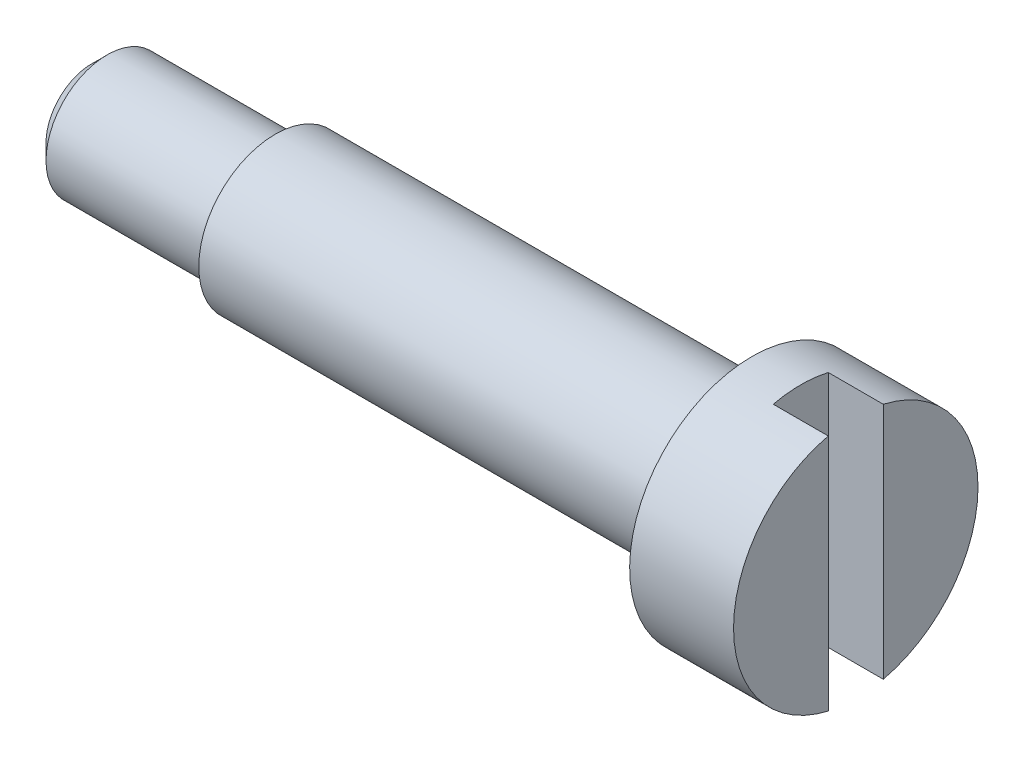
ISO-10303-21;
HEADER;
FILE_DESCRIPTION(('STEP AP214'),'2;1');
FILE_NAME('part.step','',(''),(''),'','','');
FILE_SCHEMA(('AUTOMOTIVE_DESIGN { 1 0 10303 214 1 1 1 1 }'));
ENDSEC;
DATA;
#1=APPLICATION_CONTEXT('core data for automotive mechanical design processes');
#2=APPLICATION_PROTOCOL_DEFINITION('international standard','automotive_design',2000,#1);
#3=PRODUCT_CONTEXT('',#1,'mechanical');
#4=PRODUCT('Part','Part','',(#3));
#5=PRODUCT_RELATED_PRODUCT_CATEGORY('part','',(#4));
#6=PRODUCT_DEFINITION_FORMATION('','',#4);
#7=PRODUCT_DEFINITION_CONTEXT('part definition',#1,'design');
#8=PRODUCT_DEFINITION('design','',#6,#7);
#9=PRODUCT_DEFINITION_SHAPE('','',#8);
#10=(LENGTH_UNIT() NAMED_UNIT(*) SI_UNIT(.MILLI.,.METRE.));
#11=(NAMED_UNIT(*) PLANE_ANGLE_UNIT() SI_UNIT($,.RADIAN.));
#12=(NAMED_UNIT(*) SI_UNIT($,.STERADIAN.) SOLID_ANGLE_UNIT());
#13=UNCERTAINTY_MEASURE_WITH_UNIT(LENGTH_MEASURE(1.E-05),#10,'distance_accuracy_value','');
#14=(GEOMETRIC_REPRESENTATION_CONTEXT(3) GLOBAL_UNCERTAINTY_ASSIGNED_CONTEXT((#13)) GLOBAL_UNIT_ASSIGNED_CONTEXT((#10,
#11,#12)) REPRESENTATION_CONTEXT('',''));
#15=CARTESIAN_POINT('',(0.,0.,0.));
#16=DIRECTION('',(0.,0.,1.));
#17=DIRECTION('',(1.,0.,0.));
#18=AXIS2_PLACEMENT_3D('',#15,#16,#17);
#19=CARTESIAN_POINT('',(-42.,0.,0.));
#20=DIRECTION('',(-1.,0.,0.));
#21=DIRECTION('',(0.,0.,1.));
#22=AXIS2_PLACEMENT_3D('',#19,#20,#21);
#23=PLANE('',#22);
#24=CARTESIAN_POINT('',(-42.,0.,0.));
#25=DIRECTION('',(-1.,0.,0.));
#26=DIRECTION('',(0.,0.,1.));
#27=AXIS2_PLACEMENT_3D('',#24,#25,#26);
#28=CIRCLE('',#27,1.25000000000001);
#29=CARTESIAN_POINT('',(-42.,0.,1.25000000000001));
#30=VERTEX_POINT('',#29);
#31=EDGE_CURVE('E399',#30,#30,#28,.T.);
#32=ORIENTED_EDGE('',*,*,#31,.T.);
#33=EDGE_LOOP('',(#32));
#34=FACE_BOUND('',#33,.T.);
#35=CARTESIAN_POINT('',(-42.,0.,0.));
#36=DIRECTION('',(-1.,0.,0.));
#37=DIRECTION('',(0.,0.,1.));
#38=AXIS2_PLACEMENT_3D('',#35,#36,#37);
#39=CIRCLE('',#38,0.999999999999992);
#40=CARTESIAN_POINT('',(-42.,0.,0.999999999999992));
#41=VERTEX_POINT('',#40);
#42=EDGE_CURVE('E483',#41,#41,#39,.T.);
#43=ORIENTED_EDGE('',*,*,#42,.F.);
#44=EDGE_LOOP('',(#43));
#45=FACE_BOUND('',#44,.T.);
#46=ADVANCED_FACE('F350',(#34,#45),#23,.T.);
#47=CARTESIAN_POINT('',(-34.2,0.,0.));
#48=DIRECTION('',(1.,0.,0.));
#49=DIRECTION('',(0.,0.,-1.));
#50=AXIS2_PLACEMENT_3D('',#47,#48,#49);
#51=PLANE('',#50);
#52=CARTESIAN_POINT('',(-34.2,0.,0.));
#53=DIRECTION('',(-1.,0.,0.));
#54=DIRECTION('',(0.,0.,-1.));
#55=AXIS2_PLACEMENT_3D('',#52,#53,#54);
#56=CIRCLE('',#55,1.99999999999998);
#57=CARTESIAN_POINT('',(-34.2,0.,-1.99999999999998));
#58=VERTEX_POINT('',#57);
#59=EDGE_CURVE('E421',#58,#58,#56,.T.);
#60=ORIENTED_EDGE('',*,*,#59,.T.);
#61=EDGE_LOOP('',(#60));
#62=FACE_BOUND('',#61,.T.);
#63=CARTESIAN_POINT('',(-34.2,0.,0.));
#64=DIRECTION('',(1.,0.,0.));
#65=DIRECTION('',(0.,0.,-1.));
#66=AXIS2_PLACEMENT_3D('',#63,#64,#65);
#67=CIRCLE('',#66,1.25000000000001);
#68=CARTESIAN_POINT('',(-34.2,0.,-1.25000000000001));
#69=VERTEX_POINT('',#68);
#70=EDGE_CURVE('E428',#69,#69,#67,.F.);
#71=ORIENTED_EDGE('',*,*,#70,.F.);
#72=EDGE_LOOP('',(#71));
#73=FACE_BOUND('',#72,.T.);
#74=ADVANCED_FACE('F446',(#62,#73),#51,.F.);
#75=CARTESIAN_POINT('',(-33.4,0.,0.));
#76=DIRECTION('',(1.,0.,0.));
#77=DIRECTION('',(0.,0.,-1.));
#78=AXIS2_PLACEMENT_3D('',#75,#76,#77);
#79=PLANE('',#78);
#80=CARTESIAN_POINT('',(-33.4,0.,0.));
#81=DIRECTION('',(1.,0.,0.));
#82=DIRECTION('',(0.,0.,-1.));
#83=AXIS2_PLACEMENT_3D('',#80,#81,#82);
#84=CIRCLE('',#83,1.99999999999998);
#85=CARTESIAN_POINT('',(-33.4,1.94871752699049,-0.449999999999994));
#86=VERTEX_POINT('',#85);
#87=CARTESIAN_POINT('',(-33.4,1.9487175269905,0.449999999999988));
#88=VERTEX_POINT('',#87);
#89=EDGE_CURVE('E405',#86,#88,#84,.T.);
#90=ORIENTED_EDGE('',*,*,#89,.T.);
#91=DIRECTION('',(0.,1.,0.));
#92=VECTOR('',#91,1.);
#93=CARTESIAN_POINT('',(-33.4,1.9487175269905,0.449999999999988));
#94=LINE('',#93,#92);
#95=CARTESIAN_POINT('',(-33.4,-1.94871752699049,0.449999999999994));
#96=VERTEX_POINT('',#95);
#97=EDGE_CURVE('E390',#96,#88,#94,.T.);
#98=ORIENTED_EDGE('',*,*,#97,.F.);
#99=CARTESIAN_POINT('',(-33.4,-1.94871752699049,-0.449999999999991));
#100=VERTEX_POINT('',#99);
#101=EDGE_CURVE('E412',#96,#100,#84,.T.);
#102=ORIENTED_EDGE('',*,*,#101,.T.);
#103=DIRECTION('',(0.,1.,0.));
#104=VECTOR('',#103,1.);
#105=CARTESIAN_POINT('',(-33.4,-1.94871752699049,-0.449999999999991));
#106=LINE('',#105,#104);
#107=EDGE_CURVE('E411',#100,#86,#106,.T.);
#108=ORIENTED_EDGE('',*,*,#107,.T.);
#109=EDGE_LOOP('',(#90,#98,#102,#108));
#110=FACE_BOUND('',#109,.T.);
#111=ADVANCED_FACE('F410',(#110),#79,.T.);
#112=CARTESIAN_POINT('',(-32.5,0.,0.));
#113=DIRECTION('',(-1.,0.,0.));
#114=DIRECTION('',(0.,0.,1.));
#115=AXIS2_PLACEMENT_3D('',#112,#113,#114);
#116=CYLINDRICAL_SURFACE('',#115,1.99999999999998);
#117=DIRECTION('',(1.,0.,0.));
#118=VECTOR('',#117,1.);
#119=CARTESIAN_POINT('',(-33.4,-1.94871752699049,-0.449999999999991));
#120=LINE('',#119,#118);
#121=CARTESIAN_POINT('',(-32.5,-1.94871752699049,-0.449999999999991));
#122=VERTEX_POINT('',#121);
#123=EDGE_CURVE('E373',#100,#122,#120,.T.);
#124=ORIENTED_EDGE('',*,*,#123,.F.);
#125=ORIENTED_EDGE('',*,*,#101,.F.);
#126=DIRECTION('',(-1.,0.,0.));
#127=VECTOR('',#126,1.);
#128=CARTESIAN_POINT('',(-32.5,-1.94871752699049,0.449999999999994));
#129=LINE('',#128,#127);
#130=CARTESIAN_POINT('',(-32.5,-1.94871752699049,0.449999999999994));
#131=VERTEX_POINT('',#130);
#132=EDGE_CURVE('E365',#131,#96,#129,.T.);
#133=ORIENTED_EDGE('',*,*,#132,.F.);
#134=CARTESIAN_POINT('',(-32.5,0.,0.));
#135=DIRECTION('',(1.,0.,0.));
#136=DIRECTION('',(0.,0.,1.));
#137=AXIS2_PLACEMENT_3D('',#134,#135,#136);
#138=CIRCLE('',#137,1.99999999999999);
#139=CARTESIAN_POINT('',(-32.5,1.9487175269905,0.449999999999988));
#140=VERTEX_POINT('',#139);
#141=EDGE_CURVE('E398',#140,#131,#138,.T.);
#142=ORIENTED_EDGE('',*,*,#141,.F.);
#143=DIRECTION('',(-1.,0.,0.));
#144=VECTOR('',#143,1.);
#145=CARTESIAN_POINT('',(-32.5,1.9487175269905,0.449999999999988));
#146=LINE('',#145,#144);
#147=EDGE_CURVE('E393',#140,#88,#146,.T.);
#148=ORIENTED_EDGE('',*,*,#147,.T.);
#149=ORIENTED_EDGE('',*,*,#89,.F.);
#150=DIRECTION('',(1.,0.,0.));
#151=VECTOR('',#150,1.);
#152=CARTESIAN_POINT('',(-33.4,1.94871752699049,-0.449999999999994));
#153=LINE('',#152,#151);
#154=CARTESIAN_POINT('',(-32.5,1.94871752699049,-0.449999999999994));
#155=VERTEX_POINT('',#154);
#156=EDGE_CURVE('E419',#86,#155,#153,.T.);
#157=ORIENTED_EDGE('',*,*,#156,.T.);
#158=CARTESIAN_POINT('',(-32.5,0.,0.));
#159=DIRECTION('',(-1.,0.,0.));
#160=DIRECTION('',(0.,0.,-1.));
#161=AXIS2_PLACEMENT_3D('',#158,#159,#160);
#162=CIRCLE('',#161,1.99999999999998);
#163=EDGE_CURVE('E425',#155,#122,#162,.T.);
#164=ORIENTED_EDGE('',*,*,#163,.T.);
#165=EDGE_LOOP('',(#124,#125,#133,#142,#148,#149,#157,#164));
#166=FACE_BOUND('',#165,.T.);
#167=ORIENTED_EDGE('',*,*,#59,.F.);
#168=EDGE_LOOP('',(#167));
#169=FACE_BOUND('',#168,.T.);
#170=ADVANCED_FACE('F352',(#166,#169),#116,.T.);
#171=CARTESIAN_POINT('',(-32.5,0.,0.));
#172=DIRECTION('',(1.,0.,0.));
#173=DIRECTION('',(0.,0.,-1.));
#174=AXIS2_PLACEMENT_3D('',#171,#172,#173);
#175=PLANE('',#174);
#176=DIRECTION('',(0.,1.,0.));
#177=VECTOR('',#176,1.);
#178=CARTESIAN_POINT('',(-32.5,-1.94871752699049,-0.449999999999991));
#179=LINE('',#178,#177);
#180=EDGE_CURVE('E415',#122,#155,#179,.T.);
#181=ORIENTED_EDGE('',*,*,#180,.F.);
#182=ORIENTED_EDGE('',*,*,#163,.F.);
#183=EDGE_LOOP('',(#181,#182));
#184=FACE_BOUND('',#183,.T.);
#185=ADVANCED_FACE('F472',(#184),#175,.T.);
#186=CARTESIAN_POINT('',(-33.4,-1.94871752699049,-0.449999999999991));
#187=DIRECTION('',(0.,0.,-1.));
#188=DIRECTION('',(0.,1.,0.));
#189=AXIS2_PLACEMENT_3D('',#186,#187,#188);
#190=PLANE('',#189);
#191=ORIENTED_EDGE('',*,*,#180,.T.);
#192=ORIENTED_EDGE('',*,*,#156,.F.);
#193=ORIENTED_EDGE('',*,*,#107,.F.);
#194=ORIENTED_EDGE('',*,*,#123,.T.);
#195=EDGE_LOOP('',(#191,#192,#193,#194));
#196=FACE_BOUND('',#195,.T.);
#197=ADVANCED_FACE('F468',(#196),#190,.F.);
#198=CARTESIAN_POINT('',(-32.5,1.9487175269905,0.449999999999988));
#199=DIRECTION('',(0.,0.,1.));
#200=DIRECTION('',(0.,-1.,0.));
#201=AXIS2_PLACEMENT_3D('',#198,#199,#200);
#202=PLANE('',#201);
#203=ORIENTED_EDGE('',*,*,#97,.T.);
#204=ORIENTED_EDGE('',*,*,#147,.F.);
#205=DIRECTION('',(0.,1.,0.));
#206=VECTOR('',#205,1.);
#207=CARTESIAN_POINT('',(-32.5,1.9487175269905,0.449999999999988));
#208=LINE('',#207,#206);
#209=EDGE_CURVE('E407',#131,#140,#208,.T.);
#210=ORIENTED_EDGE('',*,*,#209,.F.);
#211=ORIENTED_EDGE('',*,*,#132,.T.);
#212=EDGE_LOOP('',(#203,#204,#210,#211));
#213=FACE_BOUND('',#212,.T.);
#214=ADVANCED_FACE('F392',(#213),#202,.F.);
#215=CARTESIAN_POINT('',(-32.5,0.,0.));
#216=DIRECTION('',(-1.,0.,0.));
#217=DIRECTION('',(0.,0.,1.));
#218=AXIS2_PLACEMENT_3D('',#215,#216,#217);
#219=PLANE('',#218);
#220=ORIENTED_EDGE('',*,*,#141,.T.);
#221=ORIENTED_EDGE('',*,*,#209,.T.);
#222=EDGE_LOOP('',(#220,#221));
#223=FACE_BOUND('',#222,.T.);
#224=ADVANCED_FACE('F461',(#223),#219,.F.);
#225=CARTESIAN_POINT('',(-42.,0.,0.));
#226=DIRECTION('',(1.,0.,0.));
#227=DIRECTION('',(0.,0.,-1.));
#228=AXIS2_PLACEMENT_3D('',#225,#226,#227);
#229=CYLINDRICAL_SURFACE('',#228,1.25000000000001);
#230=ORIENTED_EDGE('',*,*,#31,.F.);
#231=EDGE_LOOP('',(#230));
#232=FACE_BOUND('',#231,.T.);
#233=ORIENTED_EDGE('',*,*,#70,.T.);
#234=EDGE_LOOP('',(#233));
#235=FACE_BOUND('',#234,.T.);
#236=ADVANCED_FACE('F458',(#232,#235),#229,.T.);
#237=CARTESIAN_POINT('',(-45.,0.,0.));
#238=DIRECTION('',(1.,0.,0.));
#239=DIRECTION('',(0.,0.,-1.));
#240=AXIS2_PLACEMENT_3D('',#237,#238,#239);
#241=CYLINDRICAL_SURFACE('',#240,0.999999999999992);
#242=CARTESIAN_POINT('',(-44.75,0.,0.));
#243=DIRECTION('',(-1.,0.,0.));
#244=DIRECTION('',(0.,0.,1.));
#245=AXIS2_PLACEMENT_3D('',#242,#243,#244);
#246=CIRCLE('',#245,0.999999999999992);
#247=CARTESIAN_POINT('',(-44.75,0.,0.999999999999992));
#248=VERTEX_POINT('',#247);
#249=EDGE_CURVE('E11',#248,#248,#246,.F.);
#250=ORIENTED_EDGE('',*,*,#249,.T.);
#251=EDGE_LOOP('',(#250));
#252=FACE_BOUND('',#251,.T.);
#253=ORIENTED_EDGE('',*,*,#42,.T.);
#254=EDGE_LOOP('',(#253));
#255=FACE_BOUND('',#254,.T.);
#256=ADVANCED_FACE('F442',(#252,#255),#241,.T.);
#257=CARTESIAN_POINT('',(-45.,0.,0.));
#258=DIRECTION('',(-1.,0.,0.));
#259=DIRECTION('',(0.,0.,1.));
#260=AXIS2_PLACEMENT_3D('',#257,#258,#259);
#261=PLANE('',#260);
#262=CARTESIAN_POINT('',(-45.,0.,0.));
#263=DIRECTION('',(-1.,0.,0.));
#264=DIRECTION('',(0.,0.,1.));
#265=AXIS2_PLACEMENT_3D('',#262,#263,#264);
#266=CIRCLE('',#265,0.749999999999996);
#267=CARTESIAN_POINT('',(-45.,0.,0.749999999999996));
#268=VERTEX_POINT('',#267);
#269=EDGE_CURVE('E358',#268,#268,#266,.T.);
#270=ORIENTED_EDGE('',*,*,#269,.T.);
#271=EDGE_LOOP('',(#270));
#272=FACE_BOUND('',#271,.T.);
#273=ADVANCED_FACE('F433',(#272),#261,.T.);
#274=CARTESIAN_POINT('',(-45.,0.,0.));
#275=DIRECTION('',(1.,0.,0.));
#276=DIRECTION('',(0.,0.,-1.));
#277=AXIS2_PLACEMENT_3D('',#274,#275,#276);
#278=CONICAL_SURFACE('',#277,0.749999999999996,0.78539816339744);
#279=ORIENTED_EDGE('',*,*,#249,.F.);
#280=EDGE_LOOP('',(#279));
#281=FACE_BOUND('',#280,.T.);
#282=ORIENTED_EDGE('',*,*,#269,.F.);
#283=EDGE_LOOP('',(#282));
#284=FACE_BOUND('',#283,.T.);
#285=ADVANCED_FACE('F435',(#281,#284),#278,.T.);
#286=CLOSED_SHELL('',(#46,#74,#111,#170,#185,#197,#214,#224,#236,#256,#273,#285));
#287=MANIFOLD_SOLID_BREP('B2',#286);
#288=ADVANCED_BREP_SHAPE_REPRESENTATION('',(#18,#287),#14);
#289=SHAPE_DEFINITION_REPRESENTATION(#9,#288);
ENDSEC;
END-ISO-10303-21;
